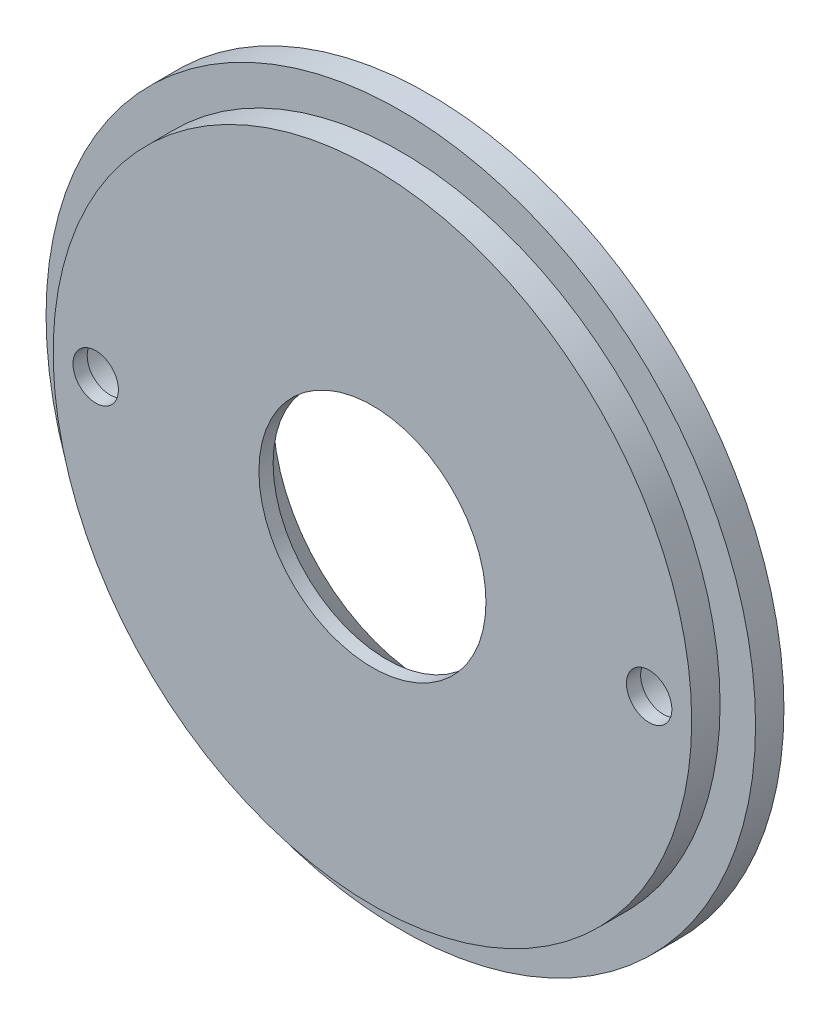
ISO-10303-21;
HEADER;
FILE_DESCRIPTION(('STEP AP214'),'2;1');
FILE_NAME('part.step','',(''),(''),'','','');
FILE_SCHEMA(('AUTOMOTIVE_DESIGN { 1 0 10303 214 1 1 1 1 }'));
ENDSEC;
DATA;
#1=APPLICATION_CONTEXT('core data for automotive mechanical design processes');
#2=APPLICATION_PROTOCOL_DEFINITION('international standard','automotive_design',2000,#1);
#3=PRODUCT_CONTEXT('',#1,'mechanical');
#4=PRODUCT('Part','Part','',(#3));
#5=PRODUCT_RELATED_PRODUCT_CATEGORY('part','',(#4));
#6=PRODUCT_DEFINITION_FORMATION('','',#4);
#7=PRODUCT_DEFINITION_CONTEXT('part definition',#1,'design');
#8=PRODUCT_DEFINITION('design','',#6,#7);
#9=PRODUCT_DEFINITION_SHAPE('','',#8);
#10=(LENGTH_UNIT() NAMED_UNIT(*) SI_UNIT(.MILLI.,.METRE.));
#11=(NAMED_UNIT(*) PLANE_ANGLE_UNIT() SI_UNIT($,.RADIAN.));
#12=(NAMED_UNIT(*) SI_UNIT($,.STERADIAN.) SOLID_ANGLE_UNIT());
#13=UNCERTAINTY_MEASURE_WITH_UNIT(LENGTH_MEASURE(1.E-05),#10,'distance_accuracy_value','');
#14=(GEOMETRIC_REPRESENTATION_CONTEXT(3) GLOBAL_UNCERTAINTY_ASSIGNED_CONTEXT((#13)) GLOBAL_UNIT_ASSIGNED_CONTEXT((#10,
#11,#12)) REPRESENTATION_CONTEXT('',''));
#15=CARTESIAN_POINT('',(0.,0.,0.));
#16=DIRECTION('',(0.,0.,1.));
#17=DIRECTION('',(1.,0.,0.));
#18=AXIS2_PLACEMENT_3D('',#15,#16,#17);
#19=CARTESIAN_POINT('',(0.,0.,-4.));
#20=DIRECTION('',(0.,0.,1.));
#21=DIRECTION('',(1.,0.,0.));
#22=AXIS2_PLACEMENT_3D('',#19,#20,#21);
#23=CYLINDRICAL_SURFACE('',#22,45.);
#24=CARTESIAN_POINT('',(0.,0.,-4.));
#25=DIRECTION('',(0.,0.,-1.));
#26=DIRECTION('',(-1.,0.,0.));
#27=AXIS2_PLACEMENT_3D('',#24,#25,#26);
#28=CIRCLE('',#27,45.);
#29=CARTESIAN_POINT('',(-45.,0.,-4.));
#30=VERTEX_POINT('',#29);
#31=EDGE_CURVE('E45',#30,#30,#28,.F.);
#32=ORIENTED_EDGE('',*,*,#31,.T.);
#33=EDGE_LOOP('',(#32));
#34=FACE_BOUND('',#33,.T.);
#35=CARTESIAN_POINT('',(0.,0.,0.));
#36=DIRECTION('',(0.,0.,1.));
#37=DIRECTION('',(1.,0.,0.));
#38=AXIS2_PLACEMENT_3D('',#35,#36,#37);
#39=CIRCLE('',#38,45.);
#40=CARTESIAN_POINT('',(45.,0.,0.));
#41=VERTEX_POINT('',#40);
#42=EDGE_CURVE('E41',#41,#41,#39,.T.);
#43=ORIENTED_EDGE('',*,*,#42,.F.);
#44=EDGE_LOOP('',(#43));
#45=FACE_BOUND('',#44,.T.);
#46=ADVANCED_FACE('F30',(#34,#45),#23,.T.);
#47=CARTESIAN_POINT('',(0.,0.,0.));
#48=DIRECTION('',(0.,0.,1.));
#49=DIRECTION('',(1.,0.,0.));
#50=AXIS2_PLACEMENT_3D('',#47,#48,#49);
#51=PLANE('',#50);
#52=CARTESIAN_POINT('',(39.,0.,0.));
#53=DIRECTION('',(0.,0.,-1.));
#54=DIRECTION('',(-1.,0.,0.));
#55=AXIS2_PLACEMENT_3D('',#52,#53,#54);
#56=CIRCLE('',#55,3.2);
#57=CARTESIAN_POINT('',(35.8,0.,0.));
#58=VERTEX_POINT('',#57);
#59=EDGE_CURVE('E80',#58,#58,#56,.T.);
#60=ORIENTED_EDGE('',*,*,#59,.T.);
#61=EDGE_LOOP('',(#60));
#62=FACE_BOUND('',#61,.T.);
#63=CARTESIAN_POINT('',(-39.,0.,0.));
#64=DIRECTION('',(0.,0.,-1.));
#65=DIRECTION('',(-1.,0.,0.));
#66=AXIS2_PLACEMENT_3D('',#63,#64,#65);
#67=CIRCLE('',#66,3.2);
#68=CARTESIAN_POINT('',(-42.2,0.,0.));
#69=VERTEX_POINT('',#68);
#70=EDGE_CURVE('E68',#69,#69,#67,.T.);
#71=ORIENTED_EDGE('',*,*,#70,.T.);
#72=EDGE_LOOP('',(#71));
#73=FACE_BOUND('',#72,.T.);
#74=CARTESIAN_POINT('',(0.,0.,0.));
#75=DIRECTION('',(0.,0.,1.));
#76=DIRECTION('',(1.,0.,0.));
#77=AXIS2_PLACEMENT_3D('',#74,#75,#76);
#78=CIRCLE('',#77,16.);
#79=CARTESIAN_POINT('',(16.,0.,0.));
#80=VERTEX_POINT('',#79);
#81=EDGE_CURVE('E54',#80,#80,#78,.T.);
#82=ORIENTED_EDGE('',*,*,#81,.F.);
#83=EDGE_LOOP('',(#82));
#84=FACE_BOUND('',#83,.T.);
#85=ORIENTED_EDGE('',*,*,#42,.T.);
#86=EDGE_LOOP('',(#85));
#87=FACE_BOUND('',#86,.T.);
#88=ADVANCED_FACE('F84',(#62,#73,#84,#87),#51,.T.);
#89=CARTESIAN_POINT('',(0.,0.,-8.));
#90=DIRECTION('',(0.,0.,1.));
#91=DIRECTION('',(1.,0.,0.));
#92=AXIS2_PLACEMENT_3D('',#89,#90,#91);
#93=CYLINDRICAL_SURFACE('',#92,50.);
#94=CARTESIAN_POINT('',(0.,0.,-8.));
#95=DIRECTION('',(0.,0.,-1.));
#96=DIRECTION('',(-1.,0.,0.));
#97=AXIS2_PLACEMENT_3D('',#94,#95,#96);
#98=CIRCLE('',#97,50.);
#99=CARTESIAN_POINT('',(-50.,0.,-8.));
#100=VERTEX_POINT('',#99);
#101=EDGE_CURVE('E50',#100,#100,#98,.T.);
#102=ORIENTED_EDGE('',*,*,#101,.F.);
#103=EDGE_LOOP('',(#102));
#104=FACE_BOUND('',#103,.T.);
#105=CARTESIAN_POINT('',(0.,0.,-4.));
#106=DIRECTION('',(0.,0.,-1.));
#107=DIRECTION('',(-1.,0.,0.));
#108=AXIS2_PLACEMENT_3D('',#105,#106,#107);
#109=CIRCLE('',#108,50.);
#110=CARTESIAN_POINT('',(-50.,0.,-4.));
#111=VERTEX_POINT('',#110);
#112=EDGE_CURVE('E51',#111,#111,#109,.T.);
#113=ORIENTED_EDGE('',*,*,#112,.T.);
#114=EDGE_LOOP('',(#113));
#115=FACE_BOUND('',#114,.T.);
#116=ADVANCED_FACE('F110',(#104,#115),#93,.T.);
#117=CARTESIAN_POINT('',(0.,0.,-8.));
#118=DIRECTION('',(0.,0.,-1.));
#119=DIRECTION('',(-1.,0.,0.));
#120=AXIS2_PLACEMENT_3D('',#117,#118,#119);
#121=PLANE('',#120);
#122=CARTESIAN_POINT('',(0.,0.,-8.));
#123=DIRECTION('',(0.,0.,-1.));
#124=DIRECTION('',(-1.,0.,0.));
#125=AXIS2_PLACEMENT_3D('',#122,#123,#124);
#126=CIRCLE('',#125,22.);
#127=CARTESIAN_POINT('',(-22.,0.,-8.));
#128=VERTEX_POINT('',#127);
#129=EDGE_CURVE('E10',#128,#128,#126,.F.);
#130=ORIENTED_EDGE('',*,*,#129,.T.);
#131=EDGE_LOOP('',(#130));
#132=FACE_BOUND('',#131,.T.);
#133=CARTESIAN_POINT('',(39.,0.,-8.));
#134=DIRECTION('',(0.,0.,-1.));
#135=DIRECTION('',(-1.,0.,0.));
#136=AXIS2_PLACEMENT_3D('',#133,#134,#135);
#137=CIRCLE('',#136,5.5);
#138=CARTESIAN_POINT('',(33.5,0.,-8.));
#139=VERTEX_POINT('',#138);
#140=EDGE_CURVE('E71',#139,#139,#137,.T.);
#141=ORIENTED_EDGE('',*,*,#140,.F.);
#142=EDGE_LOOP('',(#141));
#143=FACE_BOUND('',#142,.T.);
#144=CARTESIAN_POINT('',(-39.,0.,-8.));
#145=DIRECTION('',(0.,0.,-1.));
#146=DIRECTION('',(-1.,0.,0.));
#147=AXIS2_PLACEMENT_3D('',#144,#145,#146);
#148=CIRCLE('',#147,5.5);
#149=CARTESIAN_POINT('',(-44.5,0.,-8.));
#150=VERTEX_POINT('',#149);
#151=EDGE_CURVE('E59',#150,#150,#148,.T.);
#152=ORIENTED_EDGE('',*,*,#151,.F.);
#153=EDGE_LOOP('',(#152));
#154=FACE_BOUND('',#153,.T.);
#155=ORIENTED_EDGE('',*,*,#101,.T.);
#156=EDGE_LOOP('',(#155));
#157=FACE_BOUND('',#156,.T.);
#158=ADVANCED_FACE('F106',(#132,#143,#154,#157),#121,.T.);
#159=CARTESIAN_POINT('',(0.,0.,-4.));
#160=DIRECTION('',(0.,0.,-1.));
#161=DIRECTION('',(-1.,0.,0.));
#162=AXIS2_PLACEMENT_3D('',#159,#160,#161);
#163=PLANE('',#162);
#164=ORIENTED_EDGE('',*,*,#31,.F.);
#165=EDGE_LOOP('',(#164));
#166=FACE_BOUND('',#165,.T.);
#167=ORIENTED_EDGE('',*,*,#112,.F.);
#168=EDGE_LOOP('',(#167));
#169=FACE_BOUND('',#168,.T.);
#170=ADVANCED_FACE('F109',(#166,#169),#163,.F.);
#171=CARTESIAN_POINT('',(0.,0.,6.));
#172=DIRECTION('',(0.,0.,-1.));
#173=DIRECTION('',(-1.,0.,0.));
#174=AXIS2_PLACEMENT_3D('',#171,#172,#173);
#175=CYLINDRICAL_SURFACE('',#174,16.);
#176=CARTESIAN_POINT('',(0.,0.,-2.00000000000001));
#177=DIRECTION('',(0.,0.,-1.));
#178=DIRECTION('',(-1.,0.,0.));
#179=AXIS2_PLACEMENT_3D('',#176,#177,#178);
#180=CIRCLE('',#179,16.);
#181=CARTESIAN_POINT('',(-16.,0.,-2.00000000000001));
#182=VERTEX_POINT('',#181);
#183=EDGE_CURVE('E37',#182,#182,#180,.T.);
#184=ORIENTED_EDGE('',*,*,#183,.T.);
#185=EDGE_LOOP('',(#184));
#186=FACE_BOUND('',#185,.T.);
#187=ORIENTED_EDGE('',*,*,#81,.T.);
#188=EDGE_LOOP('',(#187));
#189=FACE_BOUND('',#188,.T.);
#190=ADVANCED_FACE('F122',(#186,#189),#175,.F.);
#191=CARTESIAN_POINT('',(-39.,0.,-8.));
#192=DIRECTION('',(0.,0.,-1.));
#193=DIRECTION('',(-1.,0.,0.));
#194=AXIS2_PLACEMENT_3D('',#191,#192,#193);
#195=CYLINDRICAL_SURFACE('',#194,5.5);
#196=CARTESIAN_POINT('',(-39.,0.,-2.));
#197=DIRECTION('',(0.,0.,-1.));
#198=DIRECTION('',(-1.,0.,0.));
#199=AXIS2_PLACEMENT_3D('',#196,#197,#198);
#200=CIRCLE('',#199,5.5);
#201=CARTESIAN_POINT('',(-44.5,0.,-2.));
#202=VERTEX_POINT('',#201);
#203=EDGE_CURVE('E62',#202,#202,#200,.T.);
#204=ORIENTED_EDGE('',*,*,#203,.F.);
#205=EDGE_LOOP('',(#204));
#206=FACE_BOUND('',#205,.T.);
#207=ORIENTED_EDGE('',*,*,#151,.T.);
#208=EDGE_LOOP('',(#207));
#209=FACE_BOUND('',#208,.T.);
#210=ADVANCED_FACE('F128',(#206,#209),#195,.F.);
#211=CARTESIAN_POINT('',(-35.8,0.,-2.));
#212=DIRECTION('',(0.,0.,1.));
#213=DIRECTION('',(1.,0.,0.));
#214=AXIS2_PLACEMENT_3D('',#211,#212,#213);
#215=PLANE('',#214);
#216=CARTESIAN_POINT('',(-39.,0.,-2.));
#217=DIRECTION('',(0.,0.,-1.));
#218=DIRECTION('',(-1.,0.,0.));
#219=AXIS2_PLACEMENT_3D('',#216,#217,#218);
#220=CIRCLE('',#219,3.2);
#221=CARTESIAN_POINT('',(-42.2,0.,-2.));
#222=VERTEX_POINT('',#221);
#223=EDGE_CURVE('E65',#222,#222,#220,.T.);
#224=ORIENTED_EDGE('',*,*,#223,.F.);
#225=EDGE_LOOP('',(#224));
#226=FACE_BOUND('',#225,.T.);
#227=ORIENTED_EDGE('',*,*,#203,.T.);
#228=EDGE_LOOP('',(#227));
#229=FACE_BOUND('',#228,.T.);
#230=ADVANCED_FACE('F188',(#226,#229),#215,.F.);
#231=CARTESIAN_POINT('',(-39.,0.,-8.));
#232=DIRECTION('',(0.,0.,-1.));
#233=DIRECTION('',(-1.,0.,0.));
#234=AXIS2_PLACEMENT_3D('',#231,#232,#233);
#235=CYLINDRICAL_SURFACE('',#234,3.2);
#236=ORIENTED_EDGE('',*,*,#70,.F.);
#237=EDGE_LOOP('',(#236));
#238=FACE_BOUND('',#237,.T.);
#239=ORIENTED_EDGE('',*,*,#223,.T.);
#240=EDGE_LOOP('',(#239));
#241=FACE_BOUND('',#240,.T.);
#242=ADVANCED_FACE('F102',(#238,#241),#235,.F.);
#243=CARTESIAN_POINT('',(39.,0.,-8.));
#244=DIRECTION('',(0.,0.,-1.));
#245=DIRECTION('',(-1.,0.,0.));
#246=AXIS2_PLACEMENT_3D('',#243,#244,#245);
#247=CYLINDRICAL_SURFACE('',#246,5.5);
#248=CARTESIAN_POINT('',(39.,0.,-2.));
#249=DIRECTION('',(0.,0.,-1.));
#250=DIRECTION('',(-1.,0.,0.));
#251=AXIS2_PLACEMENT_3D('',#248,#249,#250);
#252=CIRCLE('',#251,5.5);
#253=CARTESIAN_POINT('',(33.5,0.,-2.));
#254=VERTEX_POINT('',#253);
#255=EDGE_CURVE('E74',#254,#254,#252,.T.);
#256=ORIENTED_EDGE('',*,*,#255,.F.);
#257=EDGE_LOOP('',(#256));
#258=FACE_BOUND('',#257,.T.);
#259=ORIENTED_EDGE('',*,*,#140,.T.);
#260=EDGE_LOOP('',(#259));
#261=FACE_BOUND('',#260,.T.);
#262=ADVANCED_FACE('F96',(#258,#261),#247,.F.);
#263=CARTESIAN_POINT('',(42.2,0.,-2.));
#264=DIRECTION('',(0.,0.,1.));
#265=DIRECTION('',(1.,0.,0.));
#266=AXIS2_PLACEMENT_3D('',#263,#264,#265);
#267=PLANE('',#266);
#268=CARTESIAN_POINT('',(39.,0.,-2.));
#269=DIRECTION('',(0.,0.,-1.));
#270=DIRECTION('',(-1.,0.,0.));
#271=AXIS2_PLACEMENT_3D('',#268,#269,#270);
#272=CIRCLE('',#271,3.2);
#273=CARTESIAN_POINT('',(35.8,0.,-2.));
#274=VERTEX_POINT('',#273);
#275=EDGE_CURVE('E77',#274,#274,#272,.T.);
#276=ORIENTED_EDGE('',*,*,#275,.F.);
#277=EDGE_LOOP('',(#276));
#278=FACE_BOUND('',#277,.T.);
#279=ORIENTED_EDGE('',*,*,#255,.T.);
#280=EDGE_LOOP('',(#279));
#281=FACE_BOUND('',#280,.T.);
#282=ADVANCED_FACE('F90',(#278,#281),#267,.F.);
#283=CARTESIAN_POINT('',(39.,0.,-8.));
#284=DIRECTION('',(0.,0.,-1.));
#285=DIRECTION('',(-1.,0.,0.));
#286=AXIS2_PLACEMENT_3D('',#283,#284,#285);
#287=CYLINDRICAL_SURFACE('',#286,3.2);
#288=ORIENTED_EDGE('',*,*,#59,.F.);
#289=EDGE_LOOP('',(#288));
#290=FACE_BOUND('',#289,.T.);
#291=ORIENTED_EDGE('',*,*,#275,.T.);
#292=EDGE_LOOP('',(#291));
#293=FACE_BOUND('',#292,.T.);
#294=ADVANCED_FACE('F87',(#290,#293),#287,.F.);
#295=CARTESIAN_POINT('',(0.,0.,-2.00000000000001));
#296=DIRECTION('',(0.,0.,-1.));
#297=DIRECTION('',(-1.,0.,0.));
#298=AXIS2_PLACEMENT_3D('',#295,#296,#297);
#299=CONICAL_SURFACE('',#298,16.,0.78539816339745);
#300=ORIENTED_EDGE('',*,*,#129,.F.);
#301=EDGE_LOOP('',(#300));
#302=FACE_BOUND('',#301,.T.);
#303=ORIENTED_EDGE('',*,*,#183,.F.);
#304=EDGE_LOOP('',(#303));
#305=FACE_BOUND('',#304,.T.);
#306=ADVANCED_FACE('F32',(#302,#305),#299,.F.);
#307=CLOSED_SHELL('',(#46,#88,#116,#158,#170,#190,#210,#230,#242,#262,#282,#294,#306));
#308=MANIFOLD_SOLID_BREP('B2',#307);
#309=ADVANCED_BREP_SHAPE_REPRESENTATION('',(#18,#308),#14);
#310=SHAPE_DEFINITION_REPRESENTATION(#9,#309);
ENDSEC;
END-ISO-10303-21;
